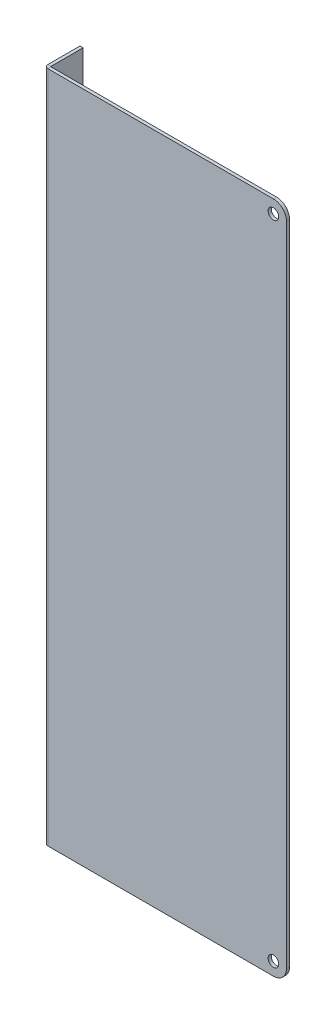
ISO-10303-21;
HEADER;
FILE_DESCRIPTION(('STEP AP214'),'2;1');
FILE_NAME('part.step','',(''),(''),'','','');
FILE_SCHEMA(('AUTOMOTIVE_DESIGN { 1 0 10303 214 1 1 1 1 }'));
ENDSEC;
DATA;
#1=APPLICATION_CONTEXT('core data for automotive mechanical design processes');
#2=APPLICATION_PROTOCOL_DEFINITION('international standard','automotive_design',2000,#1);
#3=PRODUCT_CONTEXT('',#1,'mechanical');
#4=PRODUCT('Part','Part','',(#3));
#5=PRODUCT_RELATED_PRODUCT_CATEGORY('part','',(#4));
#6=PRODUCT_DEFINITION_FORMATION('','',#4);
#7=PRODUCT_DEFINITION_CONTEXT('part definition',#1,'design');
#8=PRODUCT_DEFINITION('design','',#6,#7);
#9=PRODUCT_DEFINITION_SHAPE('','',#8);
#10=(LENGTH_UNIT() NAMED_UNIT(*) SI_UNIT(.MILLI.,.METRE.));
#11=(NAMED_UNIT(*) PLANE_ANGLE_UNIT() SI_UNIT($,.RADIAN.));
#12=(NAMED_UNIT(*) SI_UNIT($,.STERADIAN.) SOLID_ANGLE_UNIT());
#13=UNCERTAINTY_MEASURE_WITH_UNIT(LENGTH_MEASURE(1.E-05),#10,'distance_accuracy_value','');
#14=(GEOMETRIC_REPRESENTATION_CONTEXT(3) GLOBAL_UNCERTAINTY_ASSIGNED_CONTEXT((#13)) GLOBAL_UNIT_ASSIGNED_CONTEXT((#10,
#11,#12)) REPRESENTATION_CONTEXT('',''));
#15=CARTESIAN_POINT('',(0.,0.,0.));
#16=DIRECTION('',(0.,0.,1.));
#17=DIRECTION('',(1.,0.,0.));
#18=AXIS2_PLACEMENT_3D('',#15,#16,#17);
#19=CARTESIAN_POINT('',(0.,0.,0.));
#20=DIRECTION('',(0.,0.,-1.));
#21=DIRECTION('',(-1.,0.,0.));
#22=AXIS2_PLACEMENT_3D('',#19,#20,#21);
#23=PLANE('',#22);
#24=CARTESIAN_POINT('',(111.506,321.31,0.));
#25=DIRECTION('',(0.,0.,1.));
#26=DIRECTION('',(1.,0.,0.));
#27=AXIS2_PLACEMENT_3D('',#24,#25,#26);
#28=CIRCLE('',#27,2.57975100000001);
#29=CARTESIAN_POINT('',(114.085751,321.31,0.));
#30=VERTEX_POINT('',#29);
#31=EDGE_CURVE('E278',#30,#30,#28,.T.);
#32=ORIENTED_EDGE('',*,*,#31,.F.);
#33=EDGE_LOOP('',(#32));
#34=FACE_BOUND('',#33,.T.);
#35=DIRECTION('',(1.,0.,0.));
#36=VECTOR('',#35,1.);
#37=CARTESIAN_POINT('',(0.,0.,0.));
#38=LINE('',#37,#36);
#39=CARTESIAN_POINT('',(1.72212,0.,0.));
#40=VERTEX_POINT('',#39);
#41=CARTESIAN_POINT('',(111.506,0.,0.));
#42=VERTEX_POINT('',#41);
#43=EDGE_CURVE('E197',#40,#42,#38,.T.);
#44=ORIENTED_EDGE('',*,*,#43,.T.);
#45=CARTESIAN_POINT('',(111.506,6.35,0.));
#46=DIRECTION('',(0.,0.,-1.));
#47=DIRECTION('',(-1.,0.,0.));
#48=AXIS2_PLACEMENT_3D('',#45,#46,#47);
#49=CIRCLE('',#48,6.35);
#50=CARTESIAN_POINT('',(117.856,6.35,0.));
#51=VERTEX_POINT('',#50);
#52=EDGE_CURVE('E224',#42,#51,#49,.F.);
#53=ORIENTED_EDGE('',*,*,#52,.T.);
#54=DIRECTION('',(0.,1.,0.));
#55=VECTOR('',#54,1.);
#56=CARTESIAN_POINT('',(117.856,0.,0.));
#57=LINE('',#56,#55);
#58=CARTESIAN_POINT('',(117.856,321.31,0.));
#59=VERTEX_POINT('',#58);
#60=EDGE_CURVE('E211',#51,#59,#57,.T.);
#61=ORIENTED_EDGE('',*,*,#60,.T.);
#62=CARTESIAN_POINT('',(111.506,321.31,0.));
#63=DIRECTION('',(0.,0.,-1.));
#64=DIRECTION('',(-1.,0.,0.));
#65=AXIS2_PLACEMENT_3D('',#62,#63,#64);
#66=CIRCLE('',#65,6.35);
#67=CARTESIAN_POINT('',(111.506,327.66,0.));
#68=VERTEX_POINT('',#67);
#69=EDGE_CURVE('E222',#59,#68,#66,.F.);
#70=ORIENTED_EDGE('',*,*,#69,.T.);
#71=DIRECTION('',(-1.,0.,0.));
#72=VECTOR('',#71,1.);
#73=CARTESIAN_POINT('',(0.,327.66,0.));
#74=LINE('',#73,#72);
#75=CARTESIAN_POINT('',(1.72212,327.66,0.));
#76=VERTEX_POINT('',#75);
#77=EDGE_CURVE('E204',#68,#76,#74,.T.);
#78=ORIENTED_EDGE('',*,*,#77,.T.);
#79=DIRECTION('',(0.,1.,0.));
#80=VECTOR('',#79,1.);
#81=CARTESIAN_POINT('',(1.72212,327.66,0.));
#82=LINE('',#81,#80);
#83=EDGE_CURVE('E176',#76,#40,#82,.F.);
#84=ORIENTED_EDGE('',*,*,#83,.T.);
#85=EDGE_LOOP('',(#44,#53,#61,#70,#78,#84));
#86=FACE_BOUND('',#85,.T.);
#87=CARTESIAN_POINT('',(111.506,6.35,0.));
#88=DIRECTION('',(0.,0.,1.));
#89=DIRECTION('',(1.,0.,0.));
#90=AXIS2_PLACEMENT_3D('',#87,#88,#89);
#91=CIRCLE('',#90,2.57975100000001);
#92=CARTESIAN_POINT('',(114.085751,6.35,0.));
#93=VERTEX_POINT('',#92);
#94=EDGE_CURVE('E272',#93,#93,#91,.T.);
#95=ORIENTED_EDGE('',*,*,#94,.F.);
#96=EDGE_LOOP('',(#95));
#97=FACE_BOUND('',#96,.T.);
#98=ADVANCED_FACE('F56',(#34,#86,#97),#23,.F.);
#99=CARTESIAN_POINT('',(0.,327.66,-1.51892));
#100=DIRECTION('',(0.,1.,0.));
#101=DIRECTION('',(0.,0.,1.));
#102=AXIS2_PLACEMENT_3D('',#99,#100,#101);
#103=PLANE('',#102);
#104=ORIENTED_EDGE('',*,*,#77,.F.);
#105=DIRECTION('',(0.,0.,1.));
#106=VECTOR('',#105,1.);
#107=CARTESIAN_POINT('',(111.506,327.66,-1.51892));
#108=LINE('',#107,#106);
#109=CARTESIAN_POINT('',(111.506,327.66,-1.51892));
#110=VERTEX_POINT('',#109);
#111=EDGE_CURVE('E13',#68,#110,#108,.F.);
#112=ORIENTED_EDGE('',*,*,#111,.T.);
#113=DIRECTION('',(-1.,0.,0.));
#114=VECTOR('',#113,1.);
#115=CARTESIAN_POINT('',(0.,327.66,-1.51892));
#116=LINE('',#115,#114);
#117=CARTESIAN_POINT('',(1.72212,327.66,-1.51892));
#118=VERTEX_POINT('',#117);
#119=EDGE_CURVE('E206',#110,#118,#116,.T.);
#120=ORIENTED_EDGE('',*,*,#119,.T.);
#121=DIRECTION('',(0.,0.,1.));
#122=VECTOR('',#121,1.);
#123=CARTESIAN_POINT('',(1.72212,327.66,-1.51892));
#124=LINE('',#123,#122);
#125=EDGE_CURVE('E182',#118,#76,#124,.T.);
#126=ORIENTED_EDGE('',*,*,#125,.T.);
#127=EDGE_LOOP('',(#104,#112,#120,#126));
#128=FACE_BOUND('',#127,.T.);
#129=ADVANCED_FACE('F249',(#128),#103,.T.);
#130=CARTESIAN_POINT('',(0.,0.,-1.51892));
#131=DIRECTION('',(0.,0.,-1.));
#132=DIRECTION('',(-1.,0.,0.));
#133=AXIS2_PLACEMENT_3D('',#130,#131,#132);
#134=PLANE('',#133);
#135=CARTESIAN_POINT('',(111.506,321.31,-1.51892));
#136=DIRECTION('',(0.,0.,-1.));
#137=DIRECTION('',(-1.,0.,0.));
#138=AXIS2_PLACEMENT_3D('',#135,#136,#137);
#139=CIRCLE('',#138,2.579751);
#140=CARTESIAN_POINT('',(108.926249,321.31,-1.51892));
#141=VERTEX_POINT('',#140);
#142=EDGE_CURVE('E275',#141,#141,#139,.T.);
#143=ORIENTED_EDGE('',*,*,#142,.F.);
#144=EDGE_LOOP('',(#143));
#145=FACE_BOUND('',#144,.T.);
#146=CARTESIAN_POINT('',(111.506,6.35,-1.51892));
#147=DIRECTION('',(0.,0.,-1.));
#148=DIRECTION('',(-1.,0.,0.));
#149=AXIS2_PLACEMENT_3D('',#146,#147,#148);
#150=CIRCLE('',#149,2.579751);
#151=CARTESIAN_POINT('',(108.926249,6.35,-1.51892));
#152=VERTEX_POINT('',#151);
#153=EDGE_CURVE('E269',#152,#152,#150,.T.);
#154=ORIENTED_EDGE('',*,*,#153,.F.);
#155=EDGE_LOOP('',(#154));
#156=FACE_BOUND('',#155,.T.);
#157=DIRECTION('',(0.,1.,0.));
#158=VECTOR('',#157,1.);
#159=CARTESIAN_POINT('',(117.856,0.,-1.51892));
#160=LINE('',#159,#158);
#161=CARTESIAN_POINT('',(117.856,6.35,-1.51892));
#162=VERTEX_POINT('',#161);
#163=CARTESIAN_POINT('',(117.856,321.31,-1.51892));
#164=VERTEX_POINT('',#163);
#165=EDGE_CURVE('E203',#162,#164,#160,.T.);
#166=ORIENTED_EDGE('',*,*,#165,.F.);
#167=CARTESIAN_POINT('',(111.506,6.35,-1.51892));
#168=DIRECTION('',(0.,0.,-1.));
#169=DIRECTION('',(-1.,0.,0.));
#170=AXIS2_PLACEMENT_3D('',#167,#168,#169);
#171=CIRCLE('',#170,6.35);
#172=CARTESIAN_POINT('',(111.506,0.,-1.51892));
#173=VERTEX_POINT('',#172);
#174=EDGE_CURVE('E64',#162,#173,#171,.T.);
#175=ORIENTED_EDGE('',*,*,#174,.T.);
#176=DIRECTION('',(1.,0.,0.));
#177=VECTOR('',#176,1.);
#178=CARTESIAN_POINT('',(0.,0.,-1.51892));
#179=LINE('',#178,#177);
#180=CARTESIAN_POINT('',(1.72212,0.,-1.51892));
#181=VERTEX_POINT('',#180);
#182=EDGE_CURVE('E200',#181,#173,#179,.T.);
#183=ORIENTED_EDGE('',*,*,#182,.F.);
#184=DIRECTION('',(0.,1.,0.));
#185=VECTOR('',#184,1.);
#186=CARTESIAN_POINT('',(1.72212,327.66,-1.51892));
#187=LINE('',#186,#185);
#188=EDGE_CURVE('E188',#118,#181,#187,.F.);
#189=ORIENTED_EDGE('',*,*,#188,.F.);
#190=ORIENTED_EDGE('',*,*,#119,.F.);
#191=CARTESIAN_POINT('',(111.506,321.31,-1.51892));
#192=DIRECTION('',(0.,0.,-1.));
#193=DIRECTION('',(-1.,0.,0.));
#194=AXIS2_PLACEMENT_3D('',#191,#192,#193);
#195=CIRCLE('',#194,6.35);
#196=EDGE_CURVE('E76',#110,#164,#195,.T.);
#197=ORIENTED_EDGE('',*,*,#196,.T.);
#198=EDGE_LOOP('',(#166,#175,#183,#189,#190,#197));
#199=FACE_BOUND('',#198,.T.);
#200=ADVANCED_FACE('F233',(#145,#156,#199),#134,.T.);
#201=CARTESIAN_POINT('',(117.856,0.,-1.51892));
#202=DIRECTION('',(1.,0.,0.));
#203=DIRECTION('',(0.,0.,-1.));
#204=AXIS2_PLACEMENT_3D('',#201,#202,#203);
#205=PLANE('',#204);
#206=ORIENTED_EDGE('',*,*,#60,.F.);
#207=DIRECTION('',(0.,0.,1.));
#208=VECTOR('',#207,1.);
#209=CARTESIAN_POINT('',(117.856,6.35,-1.51892));
#210=LINE('',#209,#208);
#211=EDGE_CURVE('E229',#51,#162,#210,.F.);
#212=ORIENTED_EDGE('',*,*,#211,.T.);
#213=ORIENTED_EDGE('',*,*,#165,.T.);
#214=DIRECTION('',(0.,0.,1.));
#215=VECTOR('',#214,1.);
#216=CARTESIAN_POINT('',(117.856,321.31,-1.51892));
#217=LINE('',#216,#215);
#218=EDGE_CURVE('E226',#164,#59,#217,.T.);
#219=ORIENTED_EDGE('',*,*,#218,.T.);
#220=EDGE_LOOP('',(#206,#212,#213,#219));
#221=FACE_BOUND('',#220,.T.);
#222=ADVANCED_FACE('F246',(#221),#205,.T.);
#223=CARTESIAN_POINT('',(0.,0.,-1.51892));
#224=DIRECTION('',(0.,-1.,0.));
#225=DIRECTION('',(0.,0.,-1.));
#226=AXIS2_PLACEMENT_3D('',#223,#224,#225);
#227=PLANE('',#226);
#228=ORIENTED_EDGE('',*,*,#182,.T.);
#229=DIRECTION('',(0.,0.,1.));
#230=VECTOR('',#229,1.);
#231=CARTESIAN_POINT('',(111.506,0.,-1.51892));
#232=LINE('',#231,#230);
#233=EDGE_CURVE('E208',#173,#42,#232,.T.);
#234=ORIENTED_EDGE('',*,*,#233,.T.);
#235=ORIENTED_EDGE('',*,*,#43,.F.);
#236=DIRECTION('',(0.,0.,1.));
#237=VECTOR('',#236,1.);
#238=CARTESIAN_POINT('',(1.72212,0.,-1.51892));
#239=LINE('',#238,#237);
#240=EDGE_CURVE('E194',#181,#40,#239,.T.);
#241=ORIENTED_EDGE('',*,*,#240,.F.);
#242=EDGE_LOOP('',(#228,#234,#235,#241));
#243=FACE_BOUND('',#242,.T.);
#244=ADVANCED_FACE('F239',(#243),#227,.T.);
#245=CARTESIAN_POINT('',(1.72212,0.,-1.72212));
#246=DIRECTION('',(0.,-1.,0.));
#247=DIRECTION('',(0.,0.,-1.));
#248=AXIS2_PLACEMENT_3D('',#245,#246,#247);
#249=PLANE('',#248);
#250=DIRECTION('',(1.,0.,0.));
#251=VECTOR('',#250,1.);
#252=CARTESIAN_POINT('',(0.,0.,-1.72211999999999));
#253=LINE('',#252,#251);
#254=CARTESIAN_POINT('',(1.51892,0.,-1.72212));
#255=VERTEX_POINT('',#254);
#256=CARTESIAN_POINT('',(0.,0.,-1.72211999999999));
#257=VERTEX_POINT('',#256);
#258=EDGE_CURVE('E157',#255,#257,#253,.F.);
#259=ORIENTED_EDGE('',*,*,#258,.F.);
#260=CARTESIAN_POINT('',(1.72212,0.,-1.72212));
#261=DIRECTION('',(0.,1.,0.));
#262=DIRECTION('',(0.,0.,1.));
#263=AXIS2_PLACEMENT_3D('',#260,#261,#262);
#264=CIRCLE('',#263,0.2032);
#265=EDGE_CURVE('E185',#181,#255,#264,.F.);
#266=ORIENTED_EDGE('',*,*,#265,.F.);
#267=ORIENTED_EDGE('',*,*,#240,.T.);
#268=CARTESIAN_POINT('',(1.72212,0.,-1.72212));
#269=DIRECTION('',(0.,1.,0.));
#270=DIRECTION('',(0.,0.,1.));
#271=AXIS2_PLACEMENT_3D('',#268,#269,#270);
#272=CIRCLE('',#271,1.72212);
#273=EDGE_CURVE('E178',#40,#257,#272,.F.);
#274=ORIENTED_EDGE('',*,*,#273,.T.);
#275=EDGE_LOOP('',(#259,#266,#267,#274));
#276=FACE_BOUND('',#275,.T.);
#277=ADVANCED_FACE('F296',(#276),#249,.T.);
#278=CARTESIAN_POINT('',(1.72212,327.66,-1.72212));
#279=DIRECTION('',(0.,-1.,0.));
#280=DIRECTION('',(0.,0.,-1.));
#281=AXIS2_PLACEMENT_3D('',#278,#279,#280);
#282=PLANE('',#281);
#283=CARTESIAN_POINT('',(1.72212,327.66,-1.72212));
#284=DIRECTION('',(0.,1.,0.));
#285=DIRECTION('',(0.,0.,1.));
#286=AXIS2_PLACEMENT_3D('',#283,#284,#285);
#287=CIRCLE('',#286,0.2032);
#288=CARTESIAN_POINT('',(1.51892,327.66,-1.72212));
#289=VERTEX_POINT('',#288);
#290=EDGE_CURVE('E191',#289,#118,#287,.T.);
#291=ORIENTED_EDGE('',*,*,#290,.F.);
#292=DIRECTION('',(1.,0.,0.));
#293=VECTOR('',#292,1.);
#294=CARTESIAN_POINT('',(1.51892,327.66,-1.72212));
#295=LINE('',#294,#293);
#296=CARTESIAN_POINT('',(0.,327.66,-1.72211999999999));
#297=VERTEX_POINT('',#296);
#298=EDGE_CURVE('E169',#289,#297,#295,.F.);
#299=ORIENTED_EDGE('',*,*,#298,.T.);
#300=CARTESIAN_POINT('',(1.72212,327.66,-1.72212));
#301=DIRECTION('',(0.,1.,0.));
#302=DIRECTION('',(0.,0.,1.));
#303=AXIS2_PLACEMENT_3D('',#300,#301,#302);
#304=CIRCLE('',#303,1.72212);
#305=EDGE_CURVE('E179',#297,#76,#304,.T.);
#306=ORIENTED_EDGE('',*,*,#305,.T.);
#307=ORIENTED_EDGE('',*,*,#125,.F.);
#308=EDGE_LOOP('',(#291,#299,#306,#307));
#309=FACE_BOUND('',#308,.T.);
#310=ADVANCED_FACE('F257',(#309),#282,.F.);
#311=CARTESIAN_POINT('',(1.72212,327.66,-1.72212));
#312=DIRECTION('',(0.,1.,0.));
#313=DIRECTION('',(-1.,0.,0.));
#314=AXIS2_PLACEMENT_3D('',#311,#312,#313);
#315=CYLINDRICAL_SURFACE('',#314,1.72212);
#316=ORIENTED_EDGE('',*,*,#83,.F.);
#317=ORIENTED_EDGE('',*,*,#305,.F.);
#318=DIRECTION('',(0.,1.,0.));
#319=VECTOR('',#318,1.);
#320=CARTESIAN_POINT('',(0.,0.,-1.72211999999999));
#321=LINE('',#320,#319);
#322=EDGE_CURVE('E167',#297,#257,#321,.F.);
#323=ORIENTED_EDGE('',*,*,#322,.T.);
#324=ORIENTED_EDGE('',*,*,#273,.F.);
#325=EDGE_LOOP('',(#316,#317,#323,#324));
#326=FACE_BOUND('',#325,.T.);
#327=ADVANCED_FACE('F256',(#326),#315,.T.);
#328=CARTESIAN_POINT('',(1.72212,327.66,-1.72212));
#329=DIRECTION('',(0.,1.,0.));
#330=DIRECTION('',(-1.,0.,0.));
#331=AXIS2_PLACEMENT_3D('',#328,#329,#330);
#332=CYLINDRICAL_SURFACE('',#331,0.2032);
#333=ORIENTED_EDGE('',*,*,#188,.T.);
#334=ORIENTED_EDGE('',*,*,#265,.T.);
#335=DIRECTION('',(0.,1.,0.));
#336=VECTOR('',#335,1.);
#337=CARTESIAN_POINT('',(1.51892,0.,-1.72212));
#338=LINE('',#337,#336);
#339=EDGE_CURVE('E172',#255,#289,#338,.T.);
#340=ORIENTED_EDGE('',*,*,#339,.T.);
#341=ORIENTED_EDGE('',*,*,#290,.T.);
#342=EDGE_LOOP('',(#333,#334,#340,#341));
#343=FACE_BOUND('',#342,.T.);
#344=ADVANCED_FACE('F329',(#343),#332,.F.);
#345=CARTESIAN_POINT('',(0.,327.66,-17.3482));
#346=DIRECTION('',(0.,-1.,0.));
#347=DIRECTION('',(0.,0.,-1.));
#348=AXIS2_PLACEMENT_3D('',#345,#346,#347);
#349=PLANE('',#348);
#350=ORIENTED_EDGE('',*,*,#298,.F.);
#351=DIRECTION('',(0.,0.,1.));
#352=VECTOR('',#351,1.);
#353=CARTESIAN_POINT('',(1.51891999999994,327.66,-17.3482));
#354=LINE('',#353,#352);
#355=CARTESIAN_POINT('',(1.51891999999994,327.66,-17.3482));
#356=VERTEX_POINT('',#355);
#357=EDGE_CURVE('E165',#289,#356,#354,.F.);
#358=ORIENTED_EDGE('',*,*,#357,.T.);
#359=DIRECTION('',(1.,0.,0.));
#360=VECTOR('',#359,1.);
#361=CARTESIAN_POINT('',(0.,327.66,-17.3482));
#362=LINE('',#361,#360);
#363=CARTESIAN_POINT('',(0.,327.66,-17.3482));
#364=VERTEX_POINT('',#363);
#365=EDGE_CURVE('E153',#364,#356,#362,.T.);
#366=ORIENTED_EDGE('',*,*,#365,.F.);
#367=DIRECTION('',(0.,0.,-1.));
#368=VECTOR('',#367,1.);
#369=CARTESIAN_POINT('',(0.,327.66,0.));
#370=LINE('',#369,#368);
#371=EDGE_CURVE('E140',#297,#364,#370,.T.);
#372=ORIENTED_EDGE('',*,*,#371,.F.);
#373=EDGE_LOOP('',(#350,#358,#366,#372));
#374=FACE_BOUND('',#373,.T.);
#375=ADVANCED_FACE('F261',(#374),#349,.F.);
#376=CARTESIAN_POINT('',(0.,0.,-1.51891999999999));
#377=DIRECTION('',(0.,1.,0.));
#378=DIRECTION('',(0.,0.,1.));
#379=AXIS2_PLACEMENT_3D('',#376,#377,#378);
#380=PLANE('',#379);
#381=ORIENTED_EDGE('',*,*,#258,.T.);
#382=DIRECTION('',(0.,0.,1.));
#383=VECTOR('',#382,1.);
#384=CARTESIAN_POINT('',(0.,0.,0.));
#385=LINE('',#384,#383);
#386=CARTESIAN_POINT('',(0.,0.,-17.3482));
#387=VERTEX_POINT('',#386);
#388=EDGE_CURVE('E138',#387,#257,#385,.T.);
#389=ORIENTED_EDGE('',*,*,#388,.F.);
#390=DIRECTION('',(1.,0.,0.));
#391=VECTOR('',#390,1.);
#392=CARTESIAN_POINT('',(0.,0.,-17.3482));
#393=LINE('',#392,#391);
#394=CARTESIAN_POINT('',(1.51891999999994,0.,-17.3482));
#395=VERTEX_POINT('',#394);
#396=EDGE_CURVE('E146',#387,#395,#393,.T.);
#397=ORIENTED_EDGE('',*,*,#396,.T.);
#398=DIRECTION('',(0.,0.,-1.));
#399=VECTOR('',#398,1.);
#400=CARTESIAN_POINT('',(1.51892,0.,-1.51892));
#401=LINE('',#400,#399);
#402=EDGE_CURVE('E162',#395,#255,#401,.F.);
#403=ORIENTED_EDGE('',*,*,#402,.T.);
#404=EDGE_LOOP('',(#381,#389,#397,#403));
#405=FACE_BOUND('',#404,.T.);
#406=ADVANCED_FACE('F156',(#405),#380,.F.);
#407=CARTESIAN_POINT('',(0.,0.,0.));
#408=DIRECTION('',(1.,0.,0.));
#409=DIRECTION('',(0.,0.,-1.));
#410=AXIS2_PLACEMENT_3D('',#407,#408,#409);
#411=PLANE('',#410);
#412=CARTESIAN_POINT('',(0.,314.96,-8.4582));
#413=DIRECTION('',(-1.,0.,0.));
#414=DIRECTION('',(0.,0.,1.));
#415=AXIS2_PLACEMENT_3D('',#412,#413,#414);
#416=CIRCLE('',#415,2.38125);
#417=CARTESIAN_POINT('',(0.,314.96,-6.07695));
#418=VERTEX_POINT('',#417);
#419=EDGE_CURVE('E219',#418,#418,#416,.T.);
#420=ORIENTED_EDGE('',*,*,#419,.F.);
#421=EDGE_LOOP('',(#420));
#422=FACE_BOUND('',#421,.T.);
#423=CARTESIAN_POINT('',(0.,12.7,-8.4582));
#424=DIRECTION('',(-1.,0.,0.));
#425=DIRECTION('',(0.,0.,1.));
#426=AXIS2_PLACEMENT_3D('',#423,#424,#425);
#427=CIRCLE('',#426,2.38124999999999);
#428=CARTESIAN_POINT('',(0.,12.7,-6.07695000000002));
#429=VERTEX_POINT('',#428);
#430=EDGE_CURVE('E218',#429,#429,#427,.T.);
#431=ORIENTED_EDGE('',*,*,#430,.F.);
#432=EDGE_LOOP('',(#431));
#433=FACE_BOUND('',#432,.T.);
#434=ORIENTED_EDGE('',*,*,#322,.F.);
#435=ORIENTED_EDGE('',*,*,#371,.T.);
#436=DIRECTION('',(0.,-1.,0.));
#437=VECTOR('',#436,1.);
#438=CARTESIAN_POINT('',(0.,0.,-17.3482));
#439=LINE('',#438,#437);
#440=EDGE_CURVE('E133',#364,#387,#439,.T.);
#441=ORIENTED_EDGE('',*,*,#440,.T.);
#442=ORIENTED_EDGE('',*,*,#388,.T.);
#443=EDGE_LOOP('',(#434,#435,#441,#442));
#444=FACE_BOUND('',#443,.T.);
#445=ADVANCED_FACE('F136',(#422,#433,#444),#411,.F.);
#446=CARTESIAN_POINT('',(1.51892000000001,0.,0.));
#447=DIRECTION('',(1.,0.,0.));
#448=DIRECTION('',(0.,0.,-1.));
#449=AXIS2_PLACEMENT_3D('',#446,#447,#448);
#450=PLANE('',#449);
#451=CARTESIAN_POINT('',(1.51891999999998,314.96,-8.45820000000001));
#452=DIRECTION('',(1.,0.,0.));
#453=DIRECTION('',(0.,0.,-1.));
#454=AXIS2_PLACEMENT_3D('',#451,#452,#453);
#455=CIRCLE('',#454,2.38125);
#456=CARTESIAN_POINT('',(1.51891999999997,314.96,-10.83945));
#457=VERTEX_POINT('',#456);
#458=EDGE_CURVE('E215',#457,#457,#455,.T.);
#459=ORIENTED_EDGE('',*,*,#458,.F.);
#460=EDGE_LOOP('',(#459));
#461=FACE_BOUND('',#460,.T.);
#462=CARTESIAN_POINT('',(1.51891999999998,12.7,-8.45820000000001));
#463=DIRECTION('',(1.,0.,0.));
#464=DIRECTION('',(0.,0.,-1.));
#465=AXIS2_PLACEMENT_3D('',#462,#463,#464);
#466=CIRCLE('',#465,2.38124999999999);
#467=CARTESIAN_POINT('',(1.51891999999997,12.7,-10.83945));
#468=VERTEX_POINT('',#467);
#469=EDGE_CURVE('E175',#468,#468,#466,.T.);
#470=ORIENTED_EDGE('',*,*,#469,.F.);
#471=EDGE_LOOP('',(#470));
#472=FACE_BOUND('',#471,.T.);
#473=ORIENTED_EDGE('',*,*,#357,.F.);
#474=ORIENTED_EDGE('',*,*,#339,.F.);
#475=ORIENTED_EDGE('',*,*,#402,.F.);
#476=DIRECTION('',(0.,1.,0.));
#477=VECTOR('',#476,1.);
#478=CARTESIAN_POINT('',(1.51891999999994,0.,-17.3482));
#479=LINE('',#478,#477);
#480=EDGE_CURVE('E149',#356,#395,#479,.F.);
#481=ORIENTED_EDGE('',*,*,#480,.F.);
#482=EDGE_LOOP('',(#473,#474,#475,#481));
#483=FACE_BOUND('',#482,.T.);
#484=ADVANCED_FACE('F318',(#461,#472,#483),#450,.T.);
#485=CARTESIAN_POINT('',(0.,0.,-17.3482));
#486=DIRECTION('',(0.,0.,1.));
#487=DIRECTION('',(1.,0.,0.));
#488=AXIS2_PLACEMENT_3D('',#485,#486,#487);
#489=PLANE('',#488);
#490=ORIENTED_EDGE('',*,*,#480,.T.);
#491=ORIENTED_EDGE('',*,*,#396,.F.);
#492=ORIENTED_EDGE('',*,*,#440,.F.);
#493=ORIENTED_EDGE('',*,*,#365,.T.);
#494=EDGE_LOOP('',(#490,#491,#492,#493));
#495=FACE_BOUND('',#494,.T.);
#496=ADVANCED_FACE('F147',(#495),#489,.F.);
#497=CARTESIAN_POINT('',(0.,12.7,-8.4582));
#498=DIRECTION('',(-1.,0.,0.));
#499=DIRECTION('',(0.,0.,1.));
#500=AXIS2_PLACEMENT_3D('',#497,#498,#499);
#501=CYLINDRICAL_SURFACE('',#500,2.38124999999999);
#502=ORIENTED_EDGE('',*,*,#469,.T.);
#503=EDGE_LOOP('',(#502));
#504=FACE_BOUND('',#503,.T.);
#505=ORIENTED_EDGE('',*,*,#430,.T.);
#506=EDGE_LOOP('',(#505));
#507=FACE_BOUND('',#506,.T.);
#508=ADVANCED_FACE('F304',(#504,#507),#501,.F.);
#509=CARTESIAN_POINT('',(0.,314.96,-8.4582));
#510=DIRECTION('',(-1.,0.,0.));
#511=DIRECTION('',(0.,0.,1.));
#512=AXIS2_PLACEMENT_3D('',#509,#510,#511);
#513=CYLINDRICAL_SURFACE('',#512,2.38125);
#514=ORIENTED_EDGE('',*,*,#458,.T.);
#515=EDGE_LOOP('',(#514));
#516=FACE_BOUND('',#515,.T.);
#517=ORIENTED_EDGE('',*,*,#419,.T.);
#518=EDGE_LOOP('',(#517));
#519=FACE_BOUND('',#518,.T.);
#520=ADVANCED_FACE('F298',(#516,#519),#513,.F.);
#521=CARTESIAN_POINT('',(111.506,6.35,-1.51892));
#522=DIRECTION('',(0.,0.,1.));
#523=DIRECTION('',(1.,0.,0.));
#524=AXIS2_PLACEMENT_3D('',#521,#522,#523);
#525=CYLINDRICAL_SURFACE('',#524,6.35);
#526=ORIENTED_EDGE('',*,*,#174,.F.);
#527=ORIENTED_EDGE('',*,*,#211,.F.);
#528=ORIENTED_EDGE('',*,*,#52,.F.);
#529=ORIENTED_EDGE('',*,*,#233,.F.);
#530=EDGE_LOOP('',(#526,#527,#528,#529));
#531=FACE_BOUND('',#530,.T.);
#532=ADVANCED_FACE('F241',(#531),#525,.T.);
#533=CARTESIAN_POINT('',(111.506,321.31,-1.51892));
#534=DIRECTION('',(0.,0.,1.));
#535=DIRECTION('',(1.,0.,0.));
#536=AXIS2_PLACEMENT_3D('',#533,#534,#535);
#537=CYLINDRICAL_SURFACE('',#536,6.35);
#538=ORIENTED_EDGE('',*,*,#196,.F.);
#539=ORIENTED_EDGE('',*,*,#111,.F.);
#540=ORIENTED_EDGE('',*,*,#69,.F.);
#541=ORIENTED_EDGE('',*,*,#218,.F.);
#542=EDGE_LOOP('',(#538,#539,#540,#541));
#543=FACE_BOUND('',#542,.T.);
#544=ADVANCED_FACE('F58',(#543),#537,.T.);
#545=CARTESIAN_POINT('',(111.506,6.35,0.));
#546=DIRECTION('',(0.,0.,1.));
#547=DIRECTION('',(1.,0.,0.));
#548=AXIS2_PLACEMENT_3D('',#545,#546,#547);
#549=CYLINDRICAL_SURFACE('',#548,2.579751);
#550=ORIENTED_EDGE('',*,*,#153,.T.);
#551=EDGE_LOOP('',(#550));
#552=FACE_BOUND('',#551,.T.);
#553=ORIENTED_EDGE('',*,*,#94,.T.);
#554=EDGE_LOOP('',(#553));
#555=FACE_BOUND('',#554,.T.);
#556=ADVANCED_FACE('F303',(#552,#555),#549,.F.);
#557=CARTESIAN_POINT('',(111.506,321.31,0.));
#558=DIRECTION('',(0.,0.,1.));
#559=DIRECTION('',(1.,0.,0.));
#560=AXIS2_PLACEMENT_3D('',#557,#558,#559);
#561=CYLINDRICAL_SURFACE('',#560,2.579751);
#562=ORIENTED_EDGE('',*,*,#142,.T.);
#563=EDGE_LOOP('',(#562));
#564=FACE_BOUND('',#563,.T.);
#565=ORIENTED_EDGE('',*,*,#31,.T.);
#566=EDGE_LOOP('',(#565));
#567=FACE_BOUND('',#566,.T.);
#568=ADVANCED_FACE('F282',(#564,#567),#561,.F.);
#569=CLOSED_SHELL('',(#98,#129,#200,#222,#244,#277,#310,#327,#344,#375,#406,#445,#484,#496,#508,
#520,#532,#544,#556,#568));
#570=MANIFOLD_SOLID_BREP('B2',#569);
#571=ADVANCED_BREP_SHAPE_REPRESENTATION('',(#18,#570),#14);
#572=SHAPE_DEFINITION_REPRESENTATION(#9,#571);
ENDSEC;
END-ISO-10303-21;
